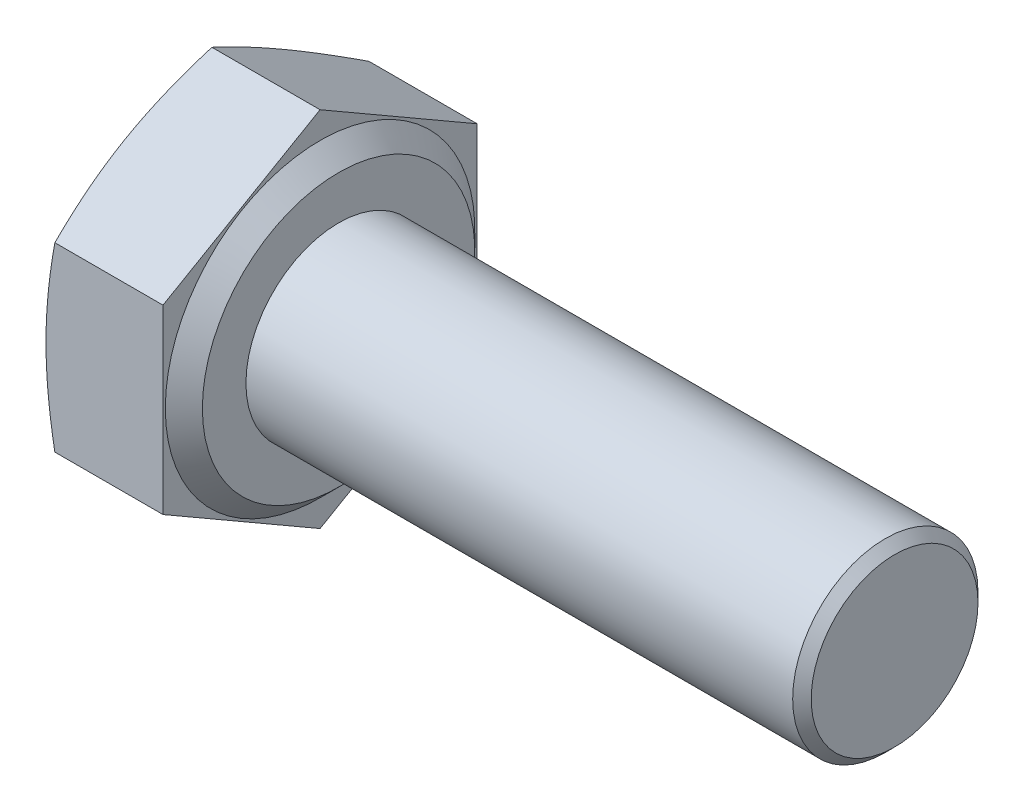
ISO-10303-21;
HEADER;
FILE_DESCRIPTION(('STEP AP214'),'2;1');
FILE_NAME('part.step','',(''),(''),'','','');
FILE_SCHEMA(('AUTOMOTIVE_DESIGN { 1 0 10303 214 1 1 1 1 }'));
ENDSEC;
DATA;
#1=APPLICATION_CONTEXT('core data for automotive mechanical design processes');
#2=APPLICATION_PROTOCOL_DEFINITION('international standard','automotive_design',2000,#1);
#3=PRODUCT_CONTEXT('',#1,'mechanical');
#4=PRODUCT('Part','Part','',(#3));
#5=PRODUCT_RELATED_PRODUCT_CATEGORY('part','',(#4));
#6=PRODUCT_DEFINITION_FORMATION('','',#4);
#7=PRODUCT_DEFINITION_CONTEXT('part definition',#1,'design');
#8=PRODUCT_DEFINITION('design','',#6,#7);
#9=PRODUCT_DEFINITION_SHAPE('','',#8);
#10=(LENGTH_UNIT() NAMED_UNIT(*) SI_UNIT(.MILLI.,.METRE.));
#11=(NAMED_UNIT(*) PLANE_ANGLE_UNIT() SI_UNIT($,.RADIAN.));
#12=(NAMED_UNIT(*) SI_UNIT($,.STERADIAN.) SOLID_ANGLE_UNIT());
#13=UNCERTAINTY_MEASURE_WITH_UNIT(LENGTH_MEASURE(1.E-05),#10,'distance_accuracy_value','');
#14=(GEOMETRIC_REPRESENTATION_CONTEXT(3) GLOBAL_UNCERTAINTY_ASSIGNED_CONTEXT((#13)) GLOBAL_UNIT_ASSIGNED_CONTEXT((#10,
#11,#12)) REPRESENTATION_CONTEXT('',''));
#15=CARTESIAN_POINT('',(0.,0.,0.));
#16=DIRECTION('',(0.,0.,1.));
#17=DIRECTION('',(1.,0.,0.));
#18=AXIS2_PLACEMENT_3D('',#15,#16,#17);
#19=CARTESIAN_POINT('',(2.925,-1.95721741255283,-3.39));
#20=DIRECTION('',(1.,0.,0.));
#21=DIRECTION('',(0.,0.,-1.));
#22=AXIS2_PLACEMENT_3D('',#19,#20,#21);
#23=PLANE('',#22);
#24=CARTESIAN_POINT('',(2.925,0.,0.));
#25=DIRECTION('',(-1.,0.,0.));
#26=DIRECTION('',(0.,0.,1.));
#27=AXIS2_PLACEMENT_3D('',#24,#25,#26);
#28=CIRCLE('',#27,2.94);
#29=CARTESIAN_POINT('',(2.925,0.,2.94));
#30=VERTEX_POINT('',#29);
#31=EDGE_CURVE('E260',#30,#30,#28,.T.);
#32=ORIENTED_EDGE('',*,*,#31,.F.);
#33=EDGE_LOOP('',(#32));
#34=FACE_BOUND('',#33,.T.);
#35=CARTESIAN_POINT('',(2.925,0.,0.));
#36=DIRECTION('',(1.,0.,0.));
#37=DIRECTION('',(0.,0.,-1.));
#38=AXIS2_PLACEMENT_3D('',#35,#36,#37);
#39=CIRCLE('',#38,2.);
#40=CARTESIAN_POINT('',(2.925,0.,-2.));
#41=VERTEX_POINT('',#40);
#42=EDGE_CURVE('E282',#41,#41,#39,.T.);
#43=ORIENTED_EDGE('',*,*,#42,.F.);
#44=EDGE_LOOP('',(#43));
#45=FACE_BOUND('',#44,.T.);
#46=ADVANCED_FACE('F30',(#34,#45),#23,.T.);
#47=CARTESIAN_POINT('',(2.925,-3.91443482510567,0.));
#48=DIRECTION('',(0.,0.866025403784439,0.5));
#49=DIRECTION('',(0.,-0.5,0.866025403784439));
#50=AXIS2_PLACEMENT_3D('',#47,#48,#49);
#51=PLANE('',#50);
#52=CARTESIAN_POINT('',(0.190920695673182,-1.957101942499,-3.3902));
#53=CARTESIAN_POINT('',(0.161404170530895,-2.03816412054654,-3.24979618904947));
#54=CARTESIAN_POINT('',(0.134553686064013,-2.11949362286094,-3.10892935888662));
#55=CARTESIAN_POINT('',(0.0873142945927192,-2.28268148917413,-2.82627968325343));
#56=CARTESIAN_POINT('',(0.0669304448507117,-2.36454021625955,-2.68449620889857));
#57=CARTESIAN_POINT('',(0.0339601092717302,-2.52787800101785,-2.40158686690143));
#58=CARTESIAN_POINT('',(0.0213017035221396,-2.6093533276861,-2.26046746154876));
#59=CARTESIAN_POINT('',(0.00432321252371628,-2.77249453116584,-1.97789860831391));
#60=CARTESIAN_POINT('',(0.,-2.85416032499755,-1.83644930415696));
#61=CARTESIAN_POINT('',(0.,-3.01749191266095,-1.55355069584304));
#62=CARTESIAN_POINT('',(0.00432321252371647,-3.09915770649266,-1.41210139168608));
#63=CARTESIAN_POINT('',(0.0213017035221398,-3.2622989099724,-1.12953253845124));
#64=CARTESIAN_POINT('',(0.0339601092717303,-3.34377423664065,-0.988413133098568));
#65=CARTESIAN_POINT('',(0.066930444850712,-3.50711202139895,-0.705503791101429));
#66=CARTESIAN_POINT('',(0.0873142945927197,-3.58897074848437,-0.563720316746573));
#67=CARTESIAN_POINT('',(0.134553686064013,-3.75215861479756,-0.281070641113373));
#68=CARTESIAN_POINT('',(0.161404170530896,-3.83348811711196,-0.140203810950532));
#69=CARTESIAN_POINT('',(0.190920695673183,-3.9145502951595,0.000200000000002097));
#70=B_SPLINE_CURVE_WITH_KNOTS('',3,(#52,#53,#54,#55,#56,#57,#58,#59,#60,#61,#62,#63,#64,#65,#66,
#67,#68,#69),.UNSPECIFIED.,.F.,.F.,(4,2,2,2,2,2,2,2,4),(0.,0.494419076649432,0.98922386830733,
1.47934907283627,1.96929035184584,2.45923163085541,2.94935683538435,3.44416162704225,
3.93858070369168),.UNSPECIFIED.);
#71=CARTESIAN_POINT('',(0.190878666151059,-1.95721741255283,-3.39));
#72=VERTEX_POINT('',#71);
#73=CARTESIAN_POINT('',(0.,-2.93582611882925,-1.695));
#74=VERTEX_POINT('',#73);
#75=EDGE_CURVE('E108',#72,#74,#70,.T.);
#76=ORIENTED_EDGE('',*,*,#75,.F.);
#77=DIRECTION('',(-1.,0.,0.));
#78=VECTOR('',#77,1.);
#79=CARTESIAN_POINT('',(2.925,-1.95721741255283,-3.39));
#80=LINE('',#79,#78);
#81=CARTESIAN_POINT('',(2.525,-1.95721741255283,-3.39));
#82=VERTEX_POINT('',#81);
#83=EDGE_CURVE('E137',#82,#72,#80,.T.);
#84=ORIENTED_EDGE('',*,*,#83,.F.);
#85=DIRECTION('',(0.,0.5,-0.866025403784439));
#86=VECTOR('',#85,1.);
#87=CARTESIAN_POINT('',(2.525,-3.91443482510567,0.));
#88=LINE('',#87,#86);
#89=CARTESIAN_POINT('',(2.525,-3.91443482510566,0.));
#90=VERTEX_POINT('',#89);
#91=EDGE_CURVE('E273',#90,#82,#88,.T.);
#92=ORIENTED_EDGE('',*,*,#91,.F.);
#93=DIRECTION('',(-1.,0.,0.));
#94=VECTOR('',#93,1.);
#95=CARTESIAN_POINT('',(2.925,-3.91443482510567,0.));
#96=LINE('',#95,#94);
#97=CARTESIAN_POINT('',(0.190878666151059,-3.91443482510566,0.));
#98=VERTEX_POINT('',#97);
#99=EDGE_CURVE('E131',#90,#98,#96,.T.);
#100=ORIENTED_EDGE('',*,*,#99,.T.);
#101=EDGE_CURVE('E161',#74,#98,#70,.T.);
#102=ORIENTED_EDGE('',*,*,#101,.F.);
#103=EDGE_LOOP('',(#76,#84,#92,#100,#102));
#104=FACE_BOUND('',#103,.T.);
#105=ADVANCED_FACE('F176',(#104),#51,.F.);
#106=CARTESIAN_POINT('',(2.925,-1.95721741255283,-3.39));
#107=DIRECTION('',(0.,0.,1.));
#108=DIRECTION('',(0.,-1.,0.));
#109=AXIS2_PLACEMENT_3D('',#106,#107,#108);
#110=PLANE('',#109);
#111=CARTESIAN_POINT('',(1.01998007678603,-5.18202410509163,-3.39));
#112=CARTESIAN_POINT('',(0.973277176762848,-5.02864822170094,-3.39));
#113=CARTESIAN_POINT('',(0.927119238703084,-4.87510331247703,-3.39));
#114=CARTESIAN_POINT('',(0.836194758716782,-4.56758939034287,-3.39));
#115=CARTESIAN_POINT('',(0.791428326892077,-4.41362034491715,-3.39));
#116=CARTESIAN_POINT('',(0.703513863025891,-4.10490856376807,-3.39));
#117=CARTESIAN_POINT('',(0.660369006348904,-3.95016492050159,-3.39));
#118=CARTESIAN_POINT('',(0.576202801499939,-3.64010200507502,-3.39));
#119=CARTESIAN_POINT('',(0.535181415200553,-3.484782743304,-3.39));
#120=CARTESIAN_POINT('',(0.456277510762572,-3.17538445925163,-3.39));
#121=CARTESIAN_POINT('',(0.418362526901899,-3.02131375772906,-3.39));
#122=CARTESIAN_POINT('',(0.345760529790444,-2.71240553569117,-3.39));
#123=CARTESIAN_POINT('',(0.311073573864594,-2.55756800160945,-3.39));
#124=CARTESIAN_POINT('',(0.24573675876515,-2.24709346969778,-3.39));
#125=CARTESIAN_POINT('',(0.215085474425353,-2.09145677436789,-3.39));
#126=CARTESIAN_POINT('',(0.158752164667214,-1.77927622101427,-3.39));
#127=CARTESIAN_POINT('',(0.133070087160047,-1.62273237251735,-3.39));
#128=CARTESIAN_POINT('',(0.0902615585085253,-1.3263632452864,-3.39));
#129=CARTESIAN_POINT('',(0.0724987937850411,-1.186630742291,-3.39));
#130=CARTESIAN_POINT('',(0.0424324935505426,-0.906588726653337,-3.39));
#131=CARTESIAN_POINT('',(0.0301282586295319,-0.766279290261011,-3.39));
#132=CARTESIAN_POINT('',(0.0115684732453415,-0.485347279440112,-3.39));
#133=CARTESIAN_POINT('',(0.00530894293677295,-0.344724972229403,-3.39));
#134=CARTESIAN_POINT('',(-0.00084342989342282,-0.0633396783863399,-3.39));
#135=CARTESIAN_POINT('',(-0.000736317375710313,0.0774233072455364,-3.39));
#136=CARTESIAN_POINT('',(0.00585535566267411,0.359511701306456,-3.39));
#137=CARTESIAN_POINT('',(0.0123722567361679,0.500836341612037,-3.39));
#138=CARTESIAN_POINT('',(0.0314839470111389,0.783070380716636,-3.39));
#139=CARTESIAN_POINT('',(0.0440788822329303,0.923979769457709,-3.39));
#140=CARTESIAN_POINT('',(0.0747561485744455,1.20531436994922,-3.39));
#141=CARTESIAN_POINT('',(0.0928431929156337,1.34573906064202,-3.39));
#142=CARTESIAN_POINT('',(0.133775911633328,1.62588403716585,-3.39));
#143=CARTESIAN_POINT('',(0.156621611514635,1.76560431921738,-3.39));
#144=CARTESIAN_POINT('',(0.233780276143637,2.19842514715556,-3.39));
#145=CARTESIAN_POINT('',(0.294955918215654,2.4902988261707,-3.39));
#146=CARTESIAN_POINT('',(0.429080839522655,3.07133562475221,-3.39));
#147=CARTESIAN_POINT('',(0.502034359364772,3.36049772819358,-3.39));
#148=CARTESIAN_POINT('',(0.65579023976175,3.93710818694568,-3.39));
#149=CARTESIAN_POINT('',(0.736602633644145,4.22455384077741,-3.39));
#150=CARTESIAN_POINT('',(0.90342621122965,4.79786777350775,-3.39));
#151=CARTESIAN_POINT('',(0.989436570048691,5.0837362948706,-3.39));
#152=CARTESIAN_POINT('',(1.16408502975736,5.65121198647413,-3.39));
#153=CARTESIAN_POINT('',(1.25268364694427,5.93283136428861,-3.39));
#154=CARTESIAN_POINT('',(1.43239750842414,6.49527820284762,-3.39));
#155=CARTESIAN_POINT('',(1.52351287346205,6.77610562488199,-3.39));
#156=CARTESIAN_POINT('',(1.70722880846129,7.33609271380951,-3.39));
#157=CARTESIAN_POINT('',(1.7998224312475,7.61525466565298,-3.39));
#158=CARTESIAN_POINT('',(1.98639796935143,8.17308908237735,-3.39));
#159=CARTESIAN_POINT('',(2.08037976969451,8.45176158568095,-3.39));
#160=CARTESIAN_POINT('',(2.17484722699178,8.73026698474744,-3.39));
#161=B_SPLINE_CURVE_WITH_KNOTS('',3,(#111,#112,#113,#114,#115,#116,#117,#118,#119,#120,#121,
#122,#123,#124,#125,#126,#127,#128,#129,#130,#131,#132,#133,#134,#135,#136,#137,#138,#139,#140,
#141,#142,#143,#144,#145,#146,#147,#148,#149,#150,#151,#152,#153,#154,#155,#156,#157,#158,#159,
#160),.UNSPECIFIED.,.F.,.F.,(4,2,2,2,2,2,2,2,2,2,2,2,2,2,2,2,2,2,2,2,2,2,2,2,4),(0.,
0.480989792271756,0.962017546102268,1.44394277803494,1.92585935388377,2.40183391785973,
2.87781693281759,3.35363140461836,3.82944088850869,4.25191903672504,4.6743430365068,
5.09648872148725,5.5186314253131,5.94291503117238,6.36720883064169,6.79186778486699,
7.2165290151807,8.11074158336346,9.00527683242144,9.90096950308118,10.7965204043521,
11.6821863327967,12.5678948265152,13.4502426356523,14.3325177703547),.UNSPECIFIED.);
#162=CARTESIAN_POINT('',(0.190878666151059,1.95721741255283,-3.39));
#163=VERTEX_POINT('',#162);
#164=CARTESIAN_POINT('',(0.,0.,-3.39));
#165=VERTEX_POINT('',#164);
#166=EDGE_CURVE('E221',#163,#165,#161,.F.);
#167=ORIENTED_EDGE('',*,*,#166,.F.);
#168=DIRECTION('',(-1.,0.,0.));
#169=VECTOR('',#168,1.);
#170=CARTESIAN_POINT('',(2.925,1.95721741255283,-3.39));
#171=LINE('',#170,#169);
#172=CARTESIAN_POINT('',(2.525,1.95721741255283,-3.39));
#173=VERTEX_POINT('',#172);
#174=EDGE_CURVE('E128',#173,#163,#171,.T.);
#175=ORIENTED_EDGE('',*,*,#174,.F.);
#176=DIRECTION('',(0.,1.,0.));
#177=VECTOR('',#176,1.);
#178=CARTESIAN_POINT('',(2.525,-1.95721741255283,-3.39));
#179=LINE('',#178,#177);
#180=EDGE_CURVE('E271',#82,#173,#179,.T.);
#181=ORIENTED_EDGE('',*,*,#180,.F.);
#182=ORIENTED_EDGE('',*,*,#83,.T.);
#183=EDGE_CURVE('E119',#165,#72,#161,.F.);
#184=ORIENTED_EDGE('',*,*,#183,.F.);
#185=EDGE_LOOP('',(#167,#175,#181,#182,#184));
#186=FACE_BOUND('',#185,.T.);
#187=ADVANCED_FACE('F228',(#186),#110,.F.);
#188=CARTESIAN_POINT('',(2.925,1.95721741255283,-3.39));
#189=DIRECTION('',(0.,-0.866025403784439,0.5));
#190=DIRECTION('',(0.,-0.5,-0.866025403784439));
#191=AXIS2_PLACEMENT_3D('',#188,#189,#190);
#192=PLANE('',#191);
#193=CARTESIAN_POINT('',(0.190920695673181,3.9145502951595,0.000199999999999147));
#194=CARTESIAN_POINT('',(0.161404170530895,3.83348811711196,-0.140203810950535));
#195=CARTESIAN_POINT('',(0.134553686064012,3.75215861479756,-0.281070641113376));
#196=CARTESIAN_POINT('',(0.0873142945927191,3.58897074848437,-0.563720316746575));
#197=CARTESIAN_POINT('',(0.0669304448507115,3.50711202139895,-0.705503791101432));
#198=CARTESIAN_POINT('',(0.0339601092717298,3.34377423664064,-0.988413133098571));
#199=CARTESIAN_POINT('',(0.0213017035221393,3.2622989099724,-1.12953253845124));
#200=CARTESIAN_POINT('',(0.004323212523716,3.09915770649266,-1.41210139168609));
#201=CARTESIAN_POINT('',(0.,3.01749191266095,-1.55355069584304));
#202=CARTESIAN_POINT('',(0.,2.85416032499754,-1.83644930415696));
#203=CARTESIAN_POINT('',(0.00432321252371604,2.77249453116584,-1.97789860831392));
#204=CARTESIAN_POINT('',(0.0213017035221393,2.6093533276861,-2.26046746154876));
#205=CARTESIAN_POINT('',(0.0339601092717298,2.52787800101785,-2.40158686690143));
#206=CARTESIAN_POINT('',(0.0669304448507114,2.36454021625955,-2.68449620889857));
#207=CARTESIAN_POINT('',(0.087314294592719,2.28268148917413,-2.82627968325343));
#208=CARTESIAN_POINT('',(0.134553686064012,2.11949362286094,-3.10892935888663));
#209=CARTESIAN_POINT('',(0.161404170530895,2.03816412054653,-3.24979618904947));
#210=CARTESIAN_POINT('',(0.190920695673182,1.95710194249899,-3.3902));
#211=B_SPLINE_CURVE_WITH_KNOTS('',3,(#193,#194,#195,#196,#197,#198,#199,#200,#201,#202,#203,
#204,#205,#206,#207,#208,#209,#210),.UNSPECIFIED.,.F.,.F.,(4,2,2,2,2,2,2,2,4),(0.,
0.494419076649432,0.989223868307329,1.47934907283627,1.96929035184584,2.45923163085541,
2.94935683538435,3.44416162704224,3.93858070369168),.UNSPECIFIED.);
#212=CARTESIAN_POINT('',(0.190878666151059,3.91443482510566,0.));
#213=VERTEX_POINT('',#212);
#214=CARTESIAN_POINT('',(0.,2.93582611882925,-1.695));
#215=VERTEX_POINT('',#214);
#216=EDGE_CURVE('E45',#213,#215,#211,.T.);
#217=ORIENTED_EDGE('',*,*,#216,.F.);
#218=DIRECTION('',(-1.,0.,0.));
#219=VECTOR('',#218,1.);
#220=CARTESIAN_POINT('',(2.925,3.91443482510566,0.));
#221=LINE('',#220,#219);
#222=CARTESIAN_POINT('',(2.525,3.91443482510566,0.));
#223=VERTEX_POINT('',#222);
#224=EDGE_CURVE('E125',#223,#213,#221,.T.);
#225=ORIENTED_EDGE('',*,*,#224,.F.);
#226=DIRECTION('',(0.,0.5,0.866025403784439));
#227=VECTOR('',#226,1.);
#228=CARTESIAN_POINT('',(2.525,1.95721741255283,-3.39));
#229=LINE('',#228,#227);
#230=EDGE_CURVE('E269',#173,#223,#229,.T.);
#231=ORIENTED_EDGE('',*,*,#230,.F.);
#232=ORIENTED_EDGE('',*,*,#174,.T.);
#233=EDGE_CURVE('E222',#215,#163,#211,.T.);
#234=ORIENTED_EDGE('',*,*,#233,.F.);
#235=EDGE_LOOP('',(#217,#225,#231,#232,#234));
#236=FACE_BOUND('',#235,.T.);
#237=ADVANCED_FACE('F231',(#236),#192,.F.);
#238=CARTESIAN_POINT('',(2.925,3.91443482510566,0.));
#239=DIRECTION('',(0.,-0.866025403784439,-0.5));
#240=DIRECTION('',(0.,0.5,-0.866025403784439));
#241=AXIS2_PLACEMENT_3D('',#238,#239,#240);
#242=PLANE('',#241);
#243=CARTESIAN_POINT('',(0.190920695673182,1.95710194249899,3.3902));
#244=CARTESIAN_POINT('',(0.161404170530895,2.03816412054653,3.24979618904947));
#245=CARTESIAN_POINT('',(0.134553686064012,2.11949362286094,3.10892935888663));
#246=CARTESIAN_POINT('',(0.0873142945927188,2.28268148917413,2.82627968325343));
#247=CARTESIAN_POINT('',(0.0669304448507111,2.36454021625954,2.68449620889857));
#248=CARTESIAN_POINT('',(0.0339601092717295,2.52787800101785,2.40158686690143));
#249=CARTESIAN_POINT('',(0.0213017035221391,2.6093533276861,2.26046746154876));
#250=CARTESIAN_POINT('',(0.00432321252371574,2.77249453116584,1.97789860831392));
#251=CARTESIAN_POINT('',(0.,2.85416032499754,1.83644930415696));
#252=CARTESIAN_POINT('',(0.,3.01749191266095,1.55355069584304));
#253=CARTESIAN_POINT('',(0.00432321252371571,3.09915770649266,1.41210139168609));
#254=CARTESIAN_POINT('',(0.0213017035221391,3.2622989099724,1.12953253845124));
#255=CARTESIAN_POINT('',(0.0339601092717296,3.34377423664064,0.98841313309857));
#256=CARTESIAN_POINT('',(0.0669304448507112,3.50711202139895,0.705503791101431));
#257=CARTESIAN_POINT('',(0.0873142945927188,3.58897074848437,0.563720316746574));
#258=CARTESIAN_POINT('',(0.134553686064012,3.75215861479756,0.281070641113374));
#259=CARTESIAN_POINT('',(0.161404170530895,3.83348811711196,0.140203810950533));
#260=CARTESIAN_POINT('',(0.190920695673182,3.9145502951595,-0.000200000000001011));
#261=B_SPLINE_CURVE_WITH_KNOTS('',3,(#243,#244,#245,#246,#247,#248,#249,#250,#251,#252,#253,
#254,#255,#256,#257,#258,#259,#260),.UNSPECIFIED.,.F.,.F.,(4,2,2,2,2,2,2,2,4),(0.,
0.494419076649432,0.98922386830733,1.47934907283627,1.96929035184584,2.45923163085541,
2.94935683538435,3.44416162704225,3.93858070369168),.UNSPECIFIED.);
#262=CARTESIAN_POINT('',(0.190878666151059,1.95721741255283,3.39));
#263=VERTEX_POINT('',#262);
#264=CARTESIAN_POINT('',(0.,2.93582611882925,1.695));
#265=VERTEX_POINT('',#264);
#266=EDGE_CURVE('E53',#263,#265,#261,.T.);
#267=ORIENTED_EDGE('',*,*,#266,.F.);
#268=DIRECTION('',(-1.,0.,0.));
#269=VECTOR('',#268,1.);
#270=CARTESIAN_POINT('',(2.925,1.95721741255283,3.39));
#271=LINE('',#270,#269);
#272=CARTESIAN_POINT('',(2.525,1.95721741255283,3.39));
#273=VERTEX_POINT('',#272);
#274=EDGE_CURVE('E116',#273,#263,#271,.T.);
#275=ORIENTED_EDGE('',*,*,#274,.F.);
#276=DIRECTION('',(0.,-0.5,0.866025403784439));
#277=VECTOR('',#276,1.);
#278=CARTESIAN_POINT('',(2.525,3.91443482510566,0.));
#279=LINE('',#278,#277);
#280=EDGE_CURVE('E267',#223,#273,#279,.T.);
#281=ORIENTED_EDGE('',*,*,#280,.F.);
#282=ORIENTED_EDGE('',*,*,#224,.T.);
#283=EDGE_CURVE('E118',#265,#213,#261,.T.);
#284=ORIENTED_EDGE('',*,*,#283,.F.);
#285=EDGE_LOOP('',(#267,#275,#281,#282,#284));
#286=FACE_BOUND('',#285,.T.);
#287=ADVANCED_FACE('F114',(#286),#242,.F.);
#288=CARTESIAN_POINT('',(2.925,1.95721741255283,3.39));
#289=DIRECTION('',(0.,0.,-1.));
#290=DIRECTION('',(-1.,0.,0.));
#291=AXIS2_PLACEMENT_3D('',#288,#289,#290);
#292=PLANE('',#291);
#293=CARTESIAN_POINT('',(1.01997989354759,-5.18202350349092,3.39));
#294=CARTESIAN_POINT('',(0.973277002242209,-5.02864764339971,3.39));
#295=CARTESIAN_POINT('',(0.927119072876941,-4.87510275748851,3.39));
#296=CARTESIAN_POINT('',(0.8361946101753,-4.56758888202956,3.39));
#297=CARTESIAN_POINT('',(0.791428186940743,-4.41361985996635,3.39));
#298=CARTESIAN_POINT('',(0.703513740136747,-4.1049081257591,3.39));
#299=CARTESIAN_POINT('',(0.660368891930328,-3.9501645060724,3.39));
#300=CARTESIAN_POINT('',(0.576202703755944,-3.64010163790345,3.39));
#301=CARTESIAN_POINT('',(0.535181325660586,-3.48478239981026,3.39));
#302=CARTESIAN_POINT('',(0.456277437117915,-3.17538416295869,3.39));
#303=CARTESIAN_POINT('',(0.418362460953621,-3.02131348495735,3.39));
#304=CARTESIAN_POINT('',(0.345760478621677,-2.71240531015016,3.39));
#305=CARTESIAN_POINT('',(0.311073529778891,-2.55756779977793,3.39));
#306=CARTESIAN_POINT('',(0.245736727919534,-2.24709331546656,3.39));
#307=CARTESIAN_POINT('',(0.21508544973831,-2.09145664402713,3.39));
#308=CARTESIAN_POINT('',(0.158752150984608,-1.7792761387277,3.39));
#309=CARTESIAN_POINT('',(0.133070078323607,-1.62273231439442,3.39));
#310=CARTESIAN_POINT('',(0.0902615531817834,-1.32636320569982,3.39));
#311=CARTESIAN_POINT('',(0.0724987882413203,-1.18663069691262,3.39));
#312=CARTESIAN_POINT('',(0.0424324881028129,-0.906588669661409,3.39));
#313=CARTESIAN_POINT('',(0.0301282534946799,-0.766279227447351,3.39));
#314=CARTESIAN_POINT('',(0.0115684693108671,-0.485347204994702,3.39));
#315=CARTESIAN_POINT('',(0.00530893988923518,-0.344724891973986,3.39));
#316=CARTESIAN_POINT('',(-0.000843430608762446,-0.0633395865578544,3.39));
#317=CARTESIAN_POINT('',(-0.000736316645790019,0.077423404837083,3.39));
#318=CARTESIAN_POINT('',(0.00585535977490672,0.359511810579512,3.39));
#319=CARTESIAN_POINT('',(0.0123722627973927,0.500836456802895,3.39));
#320=CARTESIAN_POINT('',(0.0314839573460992,0.783070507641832,3.39));
#321=CARTESIAN_POINT('',(0.0440788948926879,0.923979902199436,3.39));
#322=CARTESIAN_POINT('',(0.0747561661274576,1.2053145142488,3.39));
#323=CARTESIAN_POINT('',(0.0928432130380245,1.34573921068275,3.39));
#324=CARTESIAN_POINT('',(0.133775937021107,1.62588419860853,3.39));
#325=CARTESIAN_POINT('',(0.156621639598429,1.76560448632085,3.39));
#326=CARTESIAN_POINT('',(0.233780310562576,2.19842531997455,3.39));
#327=CARTESIAN_POINT('',(0.2949559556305,2.49029899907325,3.39));
#328=CARTESIAN_POINT('',(0.429080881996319,3.07133579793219,3.39));
#329=CARTESIAN_POINT('',(0.502034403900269,3.36049790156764,3.39));
#330=CARTESIAN_POINT('',(0.655790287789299,3.93710836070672,3.39));
#331=CARTESIAN_POINT('',(0.736602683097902,4.22455401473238,3.39));
#332=CARTESIAN_POINT('',(0.903426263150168,4.79786794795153,3.39));
#333=CARTESIAN_POINT('',(0.989436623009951,5.08373646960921,3.39));
#334=CARTESIAN_POINT('',(1.16408508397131,5.65121216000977,3.39));
#335=CARTESIAN_POINT('',(1.25268370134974,5.93283153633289,3.39));
#336=CARTESIAN_POINT('',(1.43239756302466,6.49527837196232,3.39));
#337=CARTESIAN_POINT('',(1.52351292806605,6.77610579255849,3.39));
#338=CARTESIAN_POINT('',(1.70722886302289,7.3360928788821,3.39));
#339=CARTESIAN_POINT('',(1.79982248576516,7.61525482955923,3.39));
#340=CARTESIAN_POINT('',(1.98639802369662,8.17308924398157,3.39));
#341=CARTESIAN_POINT('',(2.08037982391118,8.45176174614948,3.39));
#342=CARTESIAN_POINT('',(2.17484728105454,8.73026714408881,3.39));
#343=B_SPLINE_CURVE_WITH_KNOTS('',3,(#293,#294,#295,#296,#297,#298,#299,#300,#301,#302,#303,
#304,#305,#306,#307,#308,#309,#310,#311,#312,#313,#314,#315,#316,#317,#318,#319,#320,#321,#322,
#323,#324,#325,#326,#327,#328,#329,#330,#331,#332,#333,#334,#335,#336,#337,#338,#339,#340,#341,
#342),.UNSPECIFIED.,.F.,.F.,(4,2,2,2,2,2,2,2,2,2,2,2,2,2,2,2,2,2,2,2,2,2,2,2,4),(0.,
0.480989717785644,0.96201739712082,1.44394255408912,1.92585905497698,2.40183354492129,
2.87781648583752,3.35363088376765,3.82944029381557,4.25191845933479,4.67434247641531,
5.09648817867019,5.51863089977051,5.94291452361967,6.36720834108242,6.79186731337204,
7.21652856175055,8.11074113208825,9.00527638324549,9.90096905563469,10.7965199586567,
11.6821858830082,12.5678943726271,13.4502421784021,14.3325173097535),.UNSPECIFIED.);
#344=CARTESIAN_POINT('',(0.190878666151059,-1.95721741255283,3.39));
#345=VERTEX_POINT('',#344);
#346=CARTESIAN_POINT('',(0.,0.,3.39));
#347=VERTEX_POINT('',#346);
#348=EDGE_CURVE('E110',#345,#347,#343,.T.);
#349=ORIENTED_EDGE('',*,*,#348,.F.);
#350=DIRECTION('',(-1.,0.,0.));
#351=VECTOR('',#350,1.);
#352=CARTESIAN_POINT('',(2.925,-1.95721741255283,3.39));
#353=LINE('',#352,#351);
#354=CARTESIAN_POINT('',(2.525,-1.95721741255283,3.39));
#355=VERTEX_POINT('',#354);
#356=EDGE_CURVE('E126',#355,#345,#353,.T.);
#357=ORIENTED_EDGE('',*,*,#356,.F.);
#358=DIRECTION('',(0.,-1.,0.));
#359=VECTOR('',#358,1.);
#360=CARTESIAN_POINT('',(2.525,1.95721741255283,3.39));
#361=LINE('',#360,#359);
#362=EDGE_CURVE('E124',#273,#355,#361,.T.);
#363=ORIENTED_EDGE('',*,*,#362,.F.);
#364=ORIENTED_EDGE('',*,*,#274,.T.);
#365=EDGE_CURVE('E100',#347,#263,#343,.T.);
#366=ORIENTED_EDGE('',*,*,#365,.F.);
#367=EDGE_LOOP('',(#349,#357,#363,#364,#366));
#368=FACE_BOUND('',#367,.T.);
#369=ADVANCED_FACE('F122',(#368),#292,.F.);
#370=CARTESIAN_POINT('',(2.925,-1.95721741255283,3.39));
#371=DIRECTION('',(0.,0.866025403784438,-0.5));
#372=DIRECTION('',(0.,0.5,0.866025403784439));
#373=AXIS2_PLACEMENT_3D('',#370,#371,#372);
#374=PLANE('',#373);
#375=CARTESIAN_POINT('',(0.190920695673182,-3.9145502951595,-0.000199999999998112));
#376=CARTESIAN_POINT('',(0.161404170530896,-3.83348811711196,0.140203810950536));
#377=CARTESIAN_POINT('',(0.134553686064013,-3.75215861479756,0.281070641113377));
#378=CARTESIAN_POINT('',(0.0873142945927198,-3.58897074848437,0.563720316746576));
#379=CARTESIAN_POINT('',(0.0669304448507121,-3.50711202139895,0.705503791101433));
#380=CARTESIAN_POINT('',(0.0339601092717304,-3.34377423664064,0.988413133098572));
#381=CARTESIAN_POINT('',(0.02130170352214,-3.2622989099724,1.12953253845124));
#382=CARTESIAN_POINT('',(0.00432321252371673,-3.09915770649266,1.41210139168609));
#383=CARTESIAN_POINT('',(0.,-3.01749191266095,1.55355069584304));
#384=CARTESIAN_POINT('',(0.,-2.85416032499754,1.83644930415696));
#385=CARTESIAN_POINT('',(0.00432321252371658,-2.77249453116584,1.97789860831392));
#386=CARTESIAN_POINT('',(0.0213017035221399,-2.6093533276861,2.26046746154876));
#387=CARTESIAN_POINT('',(0.0339601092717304,-2.52787800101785,2.40158686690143));
#388=CARTESIAN_POINT('',(0.066930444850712,-2.36454021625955,2.68449620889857));
#389=CARTESIAN_POINT('',(0.0873142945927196,-2.28268148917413,2.82627968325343));
#390=CARTESIAN_POINT('',(0.134553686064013,-2.11949362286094,3.10892935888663));
#391=CARTESIAN_POINT('',(0.161404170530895,-2.03816412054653,3.24979618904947));
#392=CARTESIAN_POINT('',(0.190920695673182,-1.95710194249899,3.3902));
#393=B_SPLINE_CURVE_WITH_KNOTS('',3,(#375,#376,#377,#378,#379,#380,#381,#382,#383,#384,#385,
#386,#387,#388,#389,#390,#391,#392),.UNSPECIFIED.,.F.,.F.,(4,2,2,2,2,2,2,2,4),(0.,
0.494419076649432,0.989223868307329,1.47934907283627,1.96929035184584,2.45923163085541,
2.94935683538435,3.44416162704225,3.93858070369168),.UNSPECIFIED.);
#394=CARTESIAN_POINT('',(0.,-2.93582611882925,1.695));
#395=VERTEX_POINT('',#394);
#396=EDGE_CURVE('E163',#98,#395,#393,.T.);
#397=ORIENTED_EDGE('',*,*,#396,.F.);
#398=ORIENTED_EDGE('',*,*,#99,.F.);
#399=DIRECTION('',(0.,-0.5,-0.866025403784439));
#400=VECTOR('',#399,1.);
#401=CARTESIAN_POINT('',(2.525,-1.95721741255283,3.39));
#402=LINE('',#401,#400);
#403=EDGE_CURVE('E140',#355,#90,#402,.T.);
#404=ORIENTED_EDGE('',*,*,#403,.F.);
#405=ORIENTED_EDGE('',*,*,#356,.T.);
#406=EDGE_CURVE('E208',#395,#345,#393,.T.);
#407=ORIENTED_EDGE('',*,*,#406,.F.);
#408=EDGE_LOOP('',(#397,#398,#404,#405,#407));
#409=FACE_BOUND('',#408,.T.);
#410=ADVANCED_FACE('F240',(#409),#374,.F.);
#411=CARTESIAN_POINT('',(2.525,3.34,0.));
#412=DIRECTION('',(1.,0.,0.));
#413=DIRECTION('',(0.,0.,-1.));
#414=AXIS2_PLACEMENT_3D('',#411,#412,#413);
#415=PLANE('',#414);
#416=CARTESIAN_POINT('',(2.525,0.,0.));
#417=DIRECTION('',(-1.,0.,0.));
#418=DIRECTION('',(0.,0.,1.));
#419=AXIS2_PLACEMENT_3D('',#416,#417,#418);
#420=CIRCLE('',#419,3.34);
#421=CARTESIAN_POINT('',(2.525,0.,3.34));
#422=VERTEX_POINT('',#421);
#423=EDGE_CURVE('E263',#422,#422,#420,.T.);
#424=ORIENTED_EDGE('',*,*,#423,.T.);
#425=EDGE_LOOP('',(#424));
#426=FACE_BOUND('',#425,.T.);
#427=ORIENTED_EDGE('',*,*,#91,.T.);
#428=ORIENTED_EDGE('',*,*,#180,.T.);
#429=ORIENTED_EDGE('',*,*,#230,.T.);
#430=ORIENTED_EDGE('',*,*,#280,.T.);
#431=ORIENTED_EDGE('',*,*,#362,.T.);
#432=ORIENTED_EDGE('',*,*,#403,.T.);
#433=EDGE_LOOP('',(#427,#428,#429,#430,#431,#432));
#434=FACE_BOUND('',#433,.T.);
#435=ADVANCED_FACE('F204',(#426,#434),#415,.T.);
#436=CARTESIAN_POINT('',(2.525,0.,0.));
#437=DIRECTION('',(-1.,0.,0.));
#438=DIRECTION('',(0.,0.,1.));
#439=AXIS2_PLACEMENT_3D('',#436,#437,#438);
#440=CONICAL_SURFACE('',#439,3.34,0.785398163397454);
#441=ORIENTED_EDGE('',*,*,#31,.T.);
#442=EDGE_LOOP('',(#441));
#443=FACE_BOUND('',#442,.T.);
#444=ORIENTED_EDGE('',*,*,#423,.F.);
#445=EDGE_LOOP('',(#444));
#446=FACE_BOUND('',#445,.T.);
#447=ADVANCED_FACE('F249',(#443,#446),#440,.T.);
#448=CARTESIAN_POINT('',(0.,0.,0.));
#449=DIRECTION('',(1.,0.,0.));
#450=DIRECTION('',(0.,0.,-1.));
#451=AXIS2_PLACEMENT_3D('',#448,#449,#450);
#452=CONICAL_SURFACE('',#451,3.39,1.22173047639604);
#453=ORIENTED_EDGE('',*,*,#183,.T.);
#454=ORIENTED_EDGE('',*,*,#75,.T.);
#455=CARTESIAN_POINT('',(0.,0.,0.));
#456=DIRECTION('',(1.,0.,0.));
#457=DIRECTION('',(0.,0.,-1.));
#458=AXIS2_PLACEMENT_3D('',#455,#456,#457);
#459=CIRCLE('',#458,3.39);
#460=EDGE_CURVE('E142',#74,#165,#459,.T.);
#461=ORIENTED_EDGE('',*,*,#460,.T.);
#462=EDGE_LOOP('',(#453,#454,#461));
#463=FACE_BOUND('',#462,.T.);
#464=ADVANCED_FACE('F169',(#463),#452,.T.);
#465=ORIENTED_EDGE('',*,*,#101,.T.);
#466=ORIENTED_EDGE('',*,*,#396,.T.);
#467=EDGE_CURVE('E144',#395,#74,#459,.T.);
#468=ORIENTED_EDGE('',*,*,#467,.T.);
#469=EDGE_LOOP('',(#465,#466,#468));
#470=FACE_BOUND('',#469,.T.);
#471=ADVANCED_FACE('F159',(#470),#452,.T.);
#472=ORIENTED_EDGE('',*,*,#348,.T.);
#473=EDGE_CURVE('E153',#347,#395,#459,.T.);
#474=ORIENTED_EDGE('',*,*,#473,.T.);
#475=ORIENTED_EDGE('',*,*,#406,.T.);
#476=EDGE_LOOP('',(#472,#474,#475));
#477=FACE_BOUND('',#476,.T.);
#478=ADVANCED_FACE('F201',(#477),#452,.T.);
#479=ORIENTED_EDGE('',*,*,#266,.T.);
#480=CARTESIAN_POINT('',(0.,0.,0.));
#481=DIRECTION('',(-1.,0.,0.));
#482=DIRECTION('',(0.,0.,1.));
#483=AXIS2_PLACEMENT_3D('',#480,#481,#482);
#484=CIRCLE('',#483,3.39);
#485=EDGE_CURVE('E103',#347,#265,#484,.T.);
#486=ORIENTED_EDGE('',*,*,#485,.F.);
#487=ORIENTED_EDGE('',*,*,#365,.T.);
#488=EDGE_LOOP('',(#479,#486,#487));
#489=FACE_BOUND('',#488,.T.);
#490=ADVANCED_FACE('F101',(#489),#452,.T.);
#491=ORIENTED_EDGE('',*,*,#216,.T.);
#492=EDGE_CURVE('E149',#215,#265,#459,.T.);
#493=ORIENTED_EDGE('',*,*,#492,.T.);
#494=ORIENTED_EDGE('',*,*,#283,.T.);
#495=EDGE_LOOP('',(#491,#493,#494));
#496=FACE_BOUND('',#495,.T.);
#497=ADVANCED_FACE('F195',(#496),#452,.T.);
#498=ORIENTED_EDGE('',*,*,#233,.T.);
#499=ORIENTED_EDGE('',*,*,#166,.T.);
#500=EDGE_CURVE('E145',#165,#215,#459,.T.);
#501=ORIENTED_EDGE('',*,*,#500,.T.);
#502=EDGE_LOOP('',(#498,#499,#501));
#503=FACE_BOUND('',#502,.T.);
#504=ADVANCED_FACE('F200',(#503),#452,.T.);
#505=CARTESIAN_POINT('',(0.,-1.95721741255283,-3.39));
#506=DIRECTION('',(1.,0.,0.));
#507=DIRECTION('',(0.,0.,-1.));
#508=AXIS2_PLACEMENT_3D('',#505,#506,#507);
#509=PLANE('',#508);
#510=ORIENTED_EDGE('',*,*,#500,.F.);
#511=ORIENTED_EDGE('',*,*,#460,.F.);
#512=ORIENTED_EDGE('',*,*,#467,.F.);
#513=ORIENTED_EDGE('',*,*,#473,.F.);
#514=ORIENTED_EDGE('',*,*,#485,.T.);
#515=ORIENTED_EDGE('',*,*,#492,.F.);
#516=EDGE_LOOP('',(#510,#511,#512,#513,#514,#515));
#517=FACE_BOUND('',#516,.T.);
#518=ADVANCED_FACE('F174',(#517),#509,.F.);
#519=CARTESIAN_POINT('',(14.925,0.,0.));
#520=DIRECTION('',(-1.,0.,0.));
#521=DIRECTION('',(0.,0.,1.));
#522=AXIS2_PLACEMENT_3D('',#519,#520,#521);
#523=CYLINDRICAL_SURFACE('',#522,2.);
#524=CARTESIAN_POINT('',(14.725,0.,0.));
#525=DIRECTION('',(1.,0.,0.));
#526=DIRECTION('',(0.,0.,-1.));
#527=AXIS2_PLACEMENT_3D('',#524,#525,#526);
#528=CIRCLE('',#527,2.);
#529=CARTESIAN_POINT('',(14.725,0.,-2.));
#530=VERTEX_POINT('',#529);
#531=EDGE_CURVE('E11',#530,#530,#528,.F.);
#532=ORIENTED_EDGE('',*,*,#531,.T.);
#533=EDGE_LOOP('',(#532));
#534=FACE_BOUND('',#533,.T.);
#535=ORIENTED_EDGE('',*,*,#42,.T.);
#536=EDGE_LOOP('',(#535));
#537=FACE_BOUND('',#536,.T.);
#538=ADVANCED_FACE('F202',(#534,#537),#523,.T.);
#539=CARTESIAN_POINT('',(14.925,0.,0.));
#540=DIRECTION('',(1.,0.,0.));
#541=DIRECTION('',(0.,0.,-1.));
#542=AXIS2_PLACEMENT_3D('',#539,#540,#541);
#543=PLANE('',#542);
#544=CARTESIAN_POINT('',(14.925,0.,0.));
#545=DIRECTION('',(1.,0.,0.));
#546=DIRECTION('',(0.,0.,-1.));
#547=AXIS2_PLACEMENT_3D('',#544,#545,#546);
#548=CIRCLE('',#547,1.8);
#549=CARTESIAN_POINT('',(14.925,0.,-1.8));
#550=VERTEX_POINT('',#549);
#551=EDGE_CURVE('E38',#550,#550,#548,.T.);
#552=ORIENTED_EDGE('',*,*,#551,.T.);
#553=EDGE_LOOP('',(#552));
#554=FACE_BOUND('',#553,.T.);
#555=ADVANCED_FACE('F289',(#554),#543,.T.);
#556=CARTESIAN_POINT('',(14.925,0.,0.));
#557=DIRECTION('',(-1.,0.,0.));
#558=DIRECTION('',(0.,0.,1.));
#559=AXIS2_PLACEMENT_3D('',#556,#557,#558);
#560=CONICAL_SURFACE('',#559,1.8,0.785398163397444);
#561=ORIENTED_EDGE('',*,*,#531,.F.);
#562=EDGE_LOOP('',(#561));
#563=FACE_BOUND('',#562,.T.);
#564=ORIENTED_EDGE('',*,*,#551,.F.);
#565=EDGE_LOOP('',(#564));
#566=FACE_BOUND('',#565,.T.);
#567=ADVANCED_FACE('F32',(#563,#566),#560,.T.);
#568=CLOSED_SHELL('',(#46,#105,#187,#237,#287,#369,#410,#435,#447,#464,#471,#478,#490,#497,#504,
#518,#538,#555,#567));
#569=MANIFOLD_SOLID_BREP('B2',#568);
#570=ADVANCED_BREP_SHAPE_REPRESENTATION('',(#18,#569),#14);
#571=SHAPE_DEFINITION_REPRESENTATION(#9,#570);
ENDSEC;
END-ISO-10303-21;
